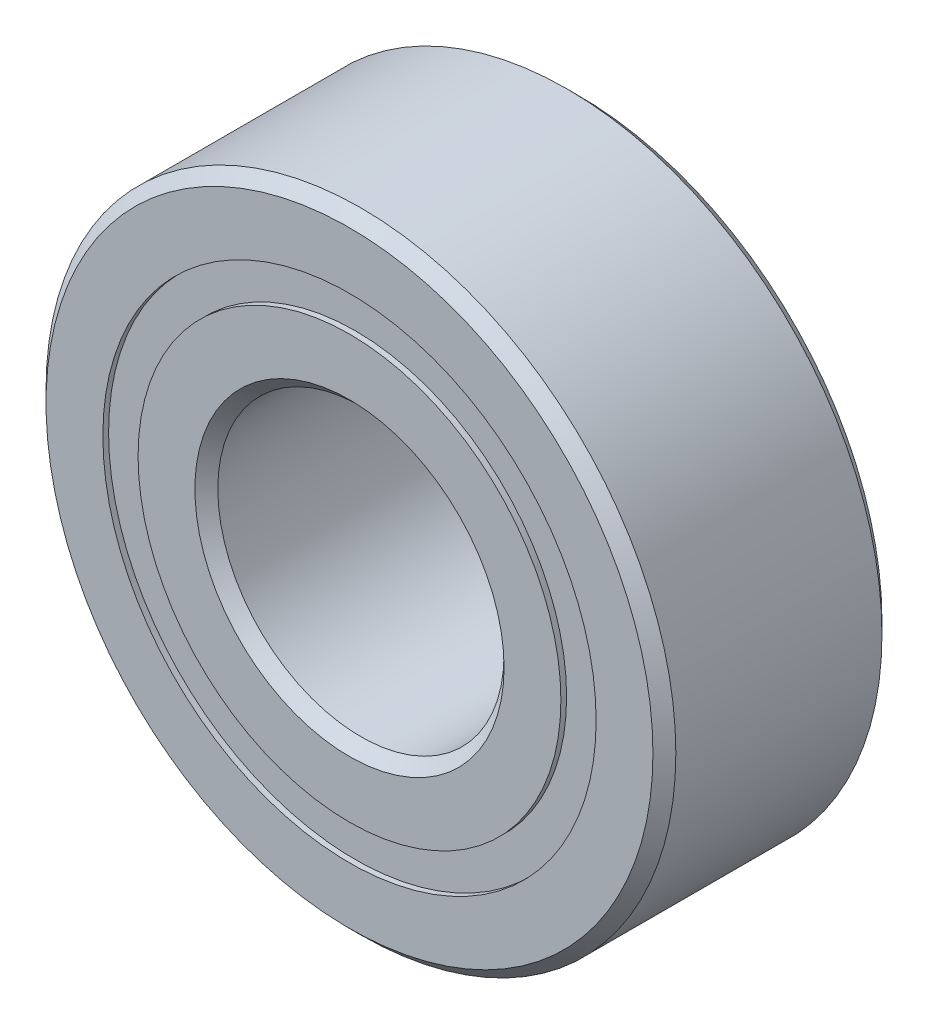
from build123d import *

# Parameters (mm, degrees)
CIRPATTERN1_COUNT = 12
SKETCH5_W         = 0.959362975
SKETCH5_H         = 0.615384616


with BuildPart() as part:
    # Sketch1 → Revolve1 (revolve)
    with BuildSketch(Plane(origin=(0, 0, 0), x_dir=(0, 0, -1), z_dir=(1, 0, 0)), mode=Mode.PRIVATE) as revolve1_sk:
        with BuildLine():
            Line((1.8, 5.5), (-1.8, 5.5))
            Line((-1.8, 5.5), (-2, 5.3))
            Line((-2, 5.3), (-2, 4.307692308))
            Line((-2, 4.307692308), (-0.888888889, 4.307692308))
            ThreePointArc((-0.888888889, 4.307692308), (0, 4.940637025), (0.888888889, 4.307692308))
            Line((0.888888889, 4.307692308), (2, 4.307692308))
            Line((2, 4.307692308), (2, 5.3))
            Line((2, 5.3), (1.8, 5.5))
        make_face()
    revolve(revolve1_sk.sketch.rotate(Axis((0, 0, 2), (0, 0, -1)), 90), axis=Axis((0, 0, 2), (0, 0, -1)))


with BuildPart() as body_2:
    # Sketch3 → Revolve3 (revolve)
    with BuildSketch(Plane(origin=(0, 0, 0), x_dir=(0, 0, -1), z_dir=(1, 0, 0)), mode=Mode.PRIVATE) as revolve3_sk:
        with BuildLine():
            Line((-2, 3.692307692), (-0.888888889, 3.692307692))
            ThreePointArc((-0.888888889, 3.692307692), (0, 3.059362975), (0.888888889, 3.692307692))
            Line((0.888888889, 3.692307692), (2, 3.692307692))
            Line((2, 3.692307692), (2, 2.7))
            Line((2, 2.7), (1.8, 2.5))
            Line((1.8, 2.5), (-1.8, 2.5))
            Line((-1.8, 2.5), (-2, 2.7))
            Line((-2, 2.7), (-2, 3.692307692))
        make_face()
    revolve(revolve3_sk.sketch.rotate(Axis((0, 0, 2), (0, 0, -1)), 90), axis=Axis((0, 0, 2), (0, 0, -1)))


with BuildPart() as body_3:
    # Sketch4 → Revolve4 (revolve)
    with BuildSketch(Plane(origin=(0, 0, 0), x_dir=(0, 0, -1), z_dir=(1, 0, 0))):
        with BuildLine():
            Line((-0.940637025, 4), (0.940637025, 4))
            ThreePointArc((0.940637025, 4), (0, 4.940637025), (-0.940637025, 4))
        make_face()
    revolve(axis=Axis((0, 4, 0.940637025), (0, 0, -1)))


with BuildPart() as cirpattern1_1:
    # CirPattern1: pattern copy
    add(body_3.part.rotate(Axis((0, 0, 0), (0, 0, 1)), 1 * 360 / CIRPATTERN1_COUNT))


with BuildPart() as cirpattern1_2:
    # CirPattern1: pattern copy
    add(body_3.part.rotate(Axis((0, 0, 0), (0, 0, 1)), 2 * 360 / CIRPATTERN1_COUNT))


with BuildPart() as cirpattern1_3:
    # CirPattern1: pattern copy
    add(body_3.part.rotate(Axis((0, 0, 0), (0, 0, 1)), 3 * 360 / CIRPATTERN1_COUNT))


with BuildPart() as cirpattern1_4:
    # CirPattern1: pattern copy
    add(body_3.part.rotate(Axis((0, 0, 0), (0, 0, 1)), 4 * 360 / CIRPATTERN1_COUNT))


with BuildPart() as cirpattern1_5:
    # CirPattern1: pattern copy
    add(body_3.part.rotate(Axis((0, 0, 0), (0, 0, 1)), 5 * 360 / CIRPATTERN1_COUNT))


with BuildPart() as cirpattern1_6:
    # CirPattern1: pattern copy
    add(body_3.part.rotate(Axis((0, 0, 0), (0, 0, 1)), 6 * 360 / CIRPATTERN1_COUNT))


with BuildPart() as cirpattern1_7:
    # CirPattern1: pattern copy
    add(body_3.part.rotate(Axis((0, 0, 0), (0, 0, 1)), 7 * 360 / CIRPATTERN1_COUNT))


with BuildPart() as cirpattern1_8:
    # CirPattern1: pattern copy
    add(body_3.part.rotate(Axis((0, 0, 0), (0, 0, 1)), 8 * 360 / CIRPATTERN1_COUNT))


with BuildPart() as cirpattern1_9:
    # CirPattern1: pattern copy
    add(body_3.part.rotate(Axis((0, 0, 0), (0, 0, 1)), 9 * 360 / CIRPATTERN1_COUNT))


with BuildPart() as cirpattern1_10:
    # CirPattern1: pattern copy
    add(body_3.part.rotate(Axis((0, 0, 0), (0, 0, 1)), 10 * 360 / CIRPATTERN1_COUNT))


with BuildPart() as cirpattern1_11:
    # CirPattern1: pattern copy
    add(body_3.part.rotate(Axis((0, 0, 0), (0, 0, 1)), 11 * 360 / CIRPATTERN1_COUNT))


with BuildPart() as body_15:
    # Sketch5 → Revolve5 (revolve)
    with BuildSketch(Plane(origin=(0, 0, 0), x_dir=(0, 0, -1), z_dir=(1, 0, 0)), mode=Mode.PRIVATE) as revolve5_sk:
        with Locations((-1.420318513, 4)):
            Rectangle(SKETCH5_W, SKETCH5_H)
        with Locations((1.420318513, 4)):
            Rectangle(SKETCH5_W, SKETCH5_H)
    revolve(revolve5_sk.sketch.rotate(Axis((0, 0, 2), (0, 0, -1)), 90), axis=Axis((0, 0, 2), (0, 0, -1)))


solid = Compound([part.part, body_2.part, body_3.part, cirpattern1_1.part, cirpattern1_2.part, cirpattern1_3.part, cirpattern1_4.part, cirpattern1_5.part, cirpattern1_6.part, cirpattern1_7.part, cirpattern1_8.part, cirpattern1_9.part, cirpattern1_10.part, cirpattern1_11.part, body_15.part])
